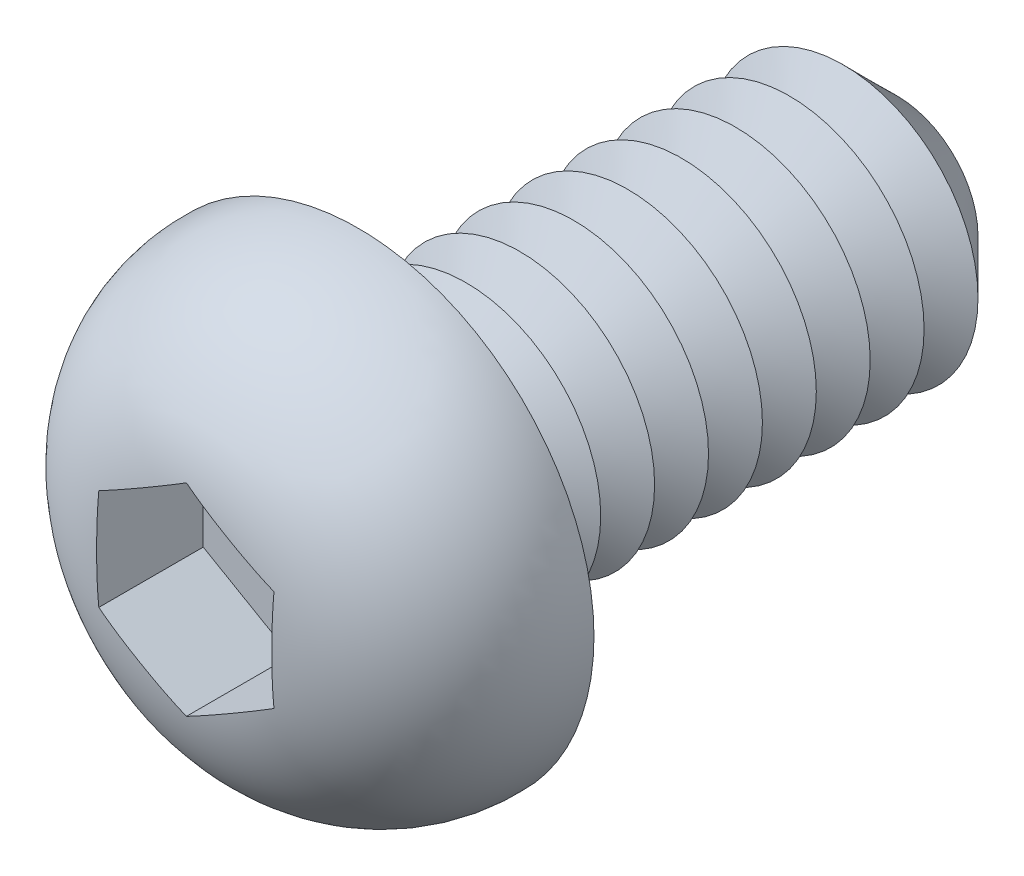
from build123d import *

# Parameters (mm, degrees)
CUT_EXTRUDE1_DEPTH  = 0.8
SKETCH4_R           = 1
BOSS_EXTRUDE1_DEPTH = 4
CHAMFER1_SIZE       = 0.4
LPATTERN1_COUNT     = 8
LPATTERN1_PITCH     = 0.4
FILLET2_R           = 0.2
SKETCH6_R           = 0.35
CUT_EXTRUDE2_DEPTH  = 4.5


with BuildPart() as part:
    # Sketch2 → Revolve1 (revolve)
    with BuildSketch(Plane(origin=(0, 0, 0), x_dir=(0, 0, -1), z_dir=(1, 0, 0)), mode=Mode.PRIVATE) as revolve1_sk:
        with BuildLine():
            Line((0, 0), (-1.3, 0))
            Line((-1.3, 0), (-1.3, 0.5010004))
            ThreePointArc((-1.3, 0.5010004), (-0.916025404, 1.402388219), (0, 1.75))
            Line((0, 1.75), (0, 0))
        make_face()
    revolve(revolve1_sk.sketch.rotate(Axis((0, 0, 47.934239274), (0, 0, -1)), 90), axis=Axis((0, 0, 47.934239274), (0, 0, -1)))

    # Sketch3 → Cut-Extrude1 (cut)
    with BuildSketch(Plane.XY.offset(1.3)):
        Polygon((0, 0.75055535), (-0.65, 0.375277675), (-0.65, -0.375277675), (0, -0.75055535), (0.65, -0.375277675), (0.65, 0.375277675), align=None)
    extrude(amount=-CUT_EXTRUDE1_DEPTH, mode=Mode.SUBTRACT)

    # Sketch4 → Boss-Extrude1 (add)
    with BuildSketch(Plane(origin=(0, 0, 0), x_dir=(-1, 0, 0), z_dir=(0, 0, -1))):
        Circle(SKETCH4_R)
    extrude(amount=BOSS_EXTRUDE1_DEPTH)

    # Chamfer1
    chamfer1_edges = [part.edges().sort_by_distance(p)[0] for p in [
        (1, 0, -4),
    ]]
    chamfer(chamfer1_edges, length=CHAMFER1_SIZE)

    # Sketch5 → Cut-Revolve1 (revolve, cut)
    with BuildSketch(Plane(origin=(0, 0, 0), x_dir=(0, 0, -1), z_dir=(1, 0, 0)), mode=Mode.PRIVATE) as cut_revolve1_sk:
        Polygon((0.4, 1), (0.8, 1), (0.6, 0.653589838), align=None)
    cut_revolve1 = revolve(cut_revolve1_sk.sketch.rotate(Axis((0, 0, 47.934239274), (0, 0, -1)), 90), axis=Axis((0, 0, 47.934239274), (0, 0, -1)), mode=Mode.SUBTRACT)

    # LPattern1: Cut-Revolve1 ×8
    with Locations(*[(0, 0, -i * LPATTERN1_PITCH) for i in range(1, LPATTERN1_COUNT)]):
        add(cut_revolve1, mode=Mode.SUBTRACT)

    # Fillet2
    fillet2_edges = [part.edges().sort_by_distance(p)[0] for p in [
        (1, 0, 0),
    ]]
    fillet(fillet2_edges, radius=FILLET2_R)

    # Sketch6 → Cut-Extrude2 (cut)
    with BuildSketch(Plane.XY.offset(0.5)):
        Circle(SKETCH6_R)
    extrude(amount=-CUT_EXTRUDE2_DEPTH, mode=Mode.SUBTRACT)


solid = part.part
